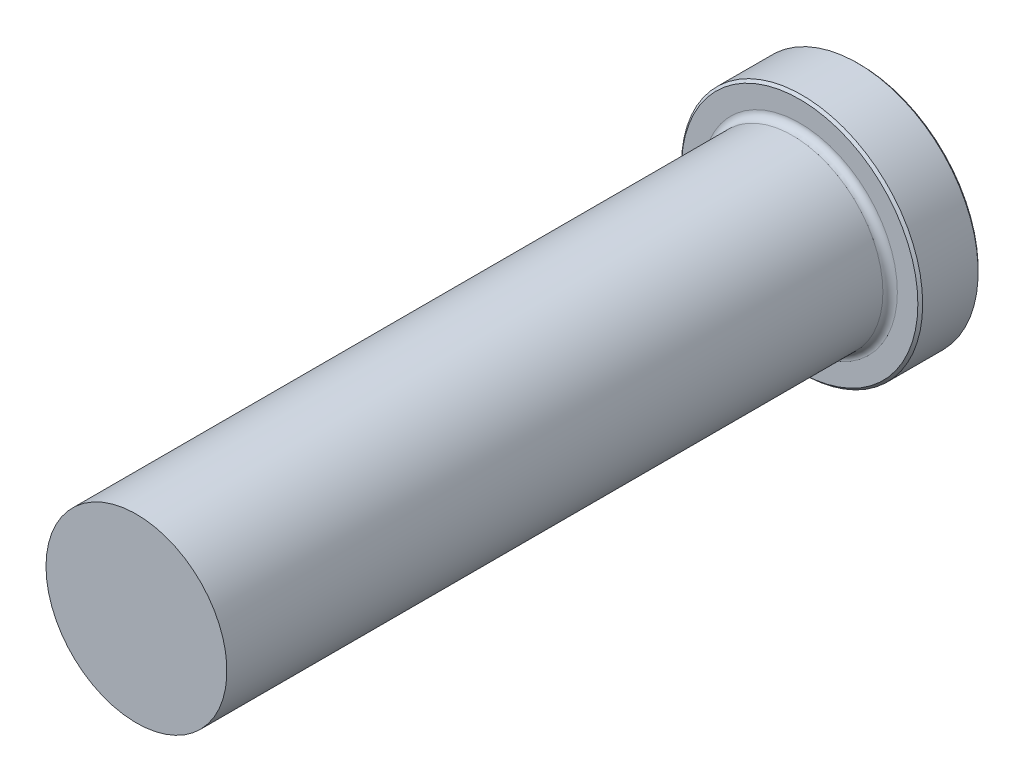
ISO-10303-21;
HEADER;
FILE_DESCRIPTION(('STEP AP214'),'2;1');
FILE_NAME('part.step','',(''),(''),'','','');
FILE_SCHEMA(('AUTOMOTIVE_DESIGN { 1 0 10303 214 1 1 1 1 }'));
ENDSEC;
DATA;
#1=APPLICATION_CONTEXT('core data for automotive mechanical design processes');
#2=APPLICATION_PROTOCOL_DEFINITION('international standard','automotive_design',2000,#1);
#3=PRODUCT_CONTEXT('',#1,'mechanical');
#4=PRODUCT('Part','Part','',(#3));
#5=PRODUCT_RELATED_PRODUCT_CATEGORY('part','',(#4));
#6=PRODUCT_DEFINITION_FORMATION('','',#4);
#7=PRODUCT_DEFINITION_CONTEXT('part definition',#1,'design');
#8=PRODUCT_DEFINITION('design','',#6,#7);
#9=PRODUCT_DEFINITION_SHAPE('','',#8);
#10=(LENGTH_UNIT() NAMED_UNIT(*) SI_UNIT(.MILLI.,.METRE.));
#11=(NAMED_UNIT(*) PLANE_ANGLE_UNIT() SI_UNIT($,.RADIAN.));
#12=(NAMED_UNIT(*) SI_UNIT($,.STERADIAN.) SOLID_ANGLE_UNIT());
#13=UNCERTAINTY_MEASURE_WITH_UNIT(LENGTH_MEASURE(1.E-05),#10,'distance_accuracy_value','');
#14=(GEOMETRIC_REPRESENTATION_CONTEXT(3) GLOBAL_UNCERTAINTY_ASSIGNED_CONTEXT((#13)) GLOBAL_UNIT_ASSIGNED_CONTEXT((#10,
#11,#12)) REPRESENTATION_CONTEXT('',''));
#15=CARTESIAN_POINT('',(0.,0.,0.));
#16=DIRECTION('',(0.,0.,1.));
#17=DIRECTION('',(1.,0.,0.));
#18=AXIS2_PLACEMENT_3D('',#15,#16,#17);
#19=CARTESIAN_POINT('',(0.,0.,0.));
#20=DIRECTION('',(0.,0.,-1.));
#21=DIRECTION('',(-1.,0.,0.));
#22=AXIS2_PLACEMENT_3D('',#19,#20,#21);
#23=PLANE('',#22);
#24=CARTESIAN_POINT('',(0.,0.,0.));
#25=DIRECTION('',(0.,0.,-1.));
#26=DIRECTION('',(-1.,0.,0.));
#27=AXIS2_PLACEMENT_3D('',#24,#25,#26);
#28=CIRCLE('',#27,12.446);
#29=CARTESIAN_POINT('',(-12.446,0.,0.));
#30=VERTEX_POINT('',#29);
#31=EDGE_CURVE('E50',#30,#30,#28,.T.);
#32=ORIENTED_EDGE('',*,*,#31,.T.);
#33=EDGE_LOOP('',(#32));
#34=FACE_BOUND('',#33,.T.);
#35=ADVANCED_FACE('F35',(#34),#23,.T.);
#36=CARTESIAN_POINT('',(0.,0.,0.));
#37=DIRECTION('',(0.,0.,-1.));
#38=DIRECTION('',(-1.,0.,0.));
#39=AXIS2_PLACEMENT_3D('',#36,#37,#38);
#40=CYLINDRICAL_SURFACE('',#39,12.7);
#41=CARTESIAN_POINT('',(0.,0.,0.254000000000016));
#42=DIRECTION('',(0.,0.,-1.));
#43=DIRECTION('',(-1.,0.,0.));
#44=AXIS2_PLACEMENT_3D('',#41,#42,#43);
#45=CIRCLE('',#44,12.7);
#46=CARTESIAN_POINT('',(-12.7,0.,0.254000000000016));
#47=VERTEX_POINT('',#46);
#48=EDGE_CURVE('E42',#47,#47,#45,.F.);
#49=ORIENTED_EDGE('',*,*,#48,.T.);
#50=EDGE_LOOP('',(#49));
#51=FACE_BOUND('',#50,.T.);
#52=CARTESIAN_POINT('',(0.,0.,6.096));
#53=DIRECTION('',(0.,0.,1.));
#54=DIRECTION('',(1.,0.,0.));
#55=AXIS2_PLACEMENT_3D('',#52,#53,#54);
#56=CIRCLE('',#55,12.7);
#57=CARTESIAN_POINT('',(12.7,0.,6.096));
#58=VERTEX_POINT('',#57);
#59=EDGE_CURVE('E46',#58,#58,#56,.F.);
#60=ORIENTED_EDGE('',*,*,#59,.T.);
#61=EDGE_LOOP('',(#60));
#62=FACE_BOUND('',#61,.T.);
#63=ADVANCED_FACE('F82',(#51,#62),#40,.T.);
#64=CARTESIAN_POINT('',(0.,12.7,6.35));
#65=DIRECTION('',(0.,0.,1.));
#66=DIRECTION('',(1.,0.,0.));
#67=AXIS2_PLACEMENT_3D('',#64,#65,#66);
#68=PLANE('',#67);
#69=CARTESIAN_POINT('',(0.,0.,6.35));
#70=DIRECTION('',(0.,0.,1.));
#71=DIRECTION('',(1.,0.,0.));
#72=AXIS2_PLACEMENT_3D('',#69,#70,#71);
#73=CIRCLE('',#72,12.446);
#74=CARTESIAN_POINT('',(12.446,0.,6.35));
#75=VERTEX_POINT('',#74);
#76=EDGE_CURVE('E10',#75,#75,#73,.T.);
#77=ORIENTED_EDGE('',*,*,#76,.T.);
#78=EDGE_LOOP('',(#77));
#79=FACE_BOUND('',#78,.T.);
#80=CARTESIAN_POINT('',(0.,0.,6.35));
#81=DIRECTION('',(0.,0.,1.));
#82=DIRECTION('',(1.,0.,0.));
#83=AXIS2_PLACEMENT_3D('',#80,#81,#82);
#84=CIRCLE('',#83,10.287);
#85=CARTESIAN_POINT('',(10.287,0.,6.35));
#86=VERTEX_POINT('',#85);
#87=EDGE_CURVE('E58',#86,#86,#84,.F.);
#88=ORIENTED_EDGE('',*,*,#87,.T.);
#89=EDGE_LOOP('',(#88));
#90=FACE_BOUND('',#89,.T.);
#91=ADVANCED_FACE('F78',(#79,#90),#68,.T.);
#92=CARTESIAN_POINT('',(0.,0.,0.));
#93=DIRECTION('',(0.,0.,-1.));
#94=DIRECTION('',(-1.,0.,0.));
#95=AXIS2_PLACEMENT_3D('',#92,#93,#94);
#96=CYLINDRICAL_SURFACE('',#95,9.525);
#97=CARTESIAN_POINT('',(0.,0.,7.112));
#98=DIRECTION('',(0.,0.,1.));
#99=DIRECTION('',(1.,0.,0.));
#100=AXIS2_PLACEMENT_3D('',#97,#98,#99);
#101=CIRCLE('',#100,9.525);
#102=CARTESIAN_POINT('',(9.525,0.,7.112));
#103=VERTEX_POINT('',#102);
#104=EDGE_CURVE('E55',#103,#103,#101,.T.);
#105=ORIENTED_EDGE('',*,*,#104,.T.);
#106=EDGE_LOOP('',(#105));
#107=FACE_BOUND('',#106,.T.);
#108=CARTESIAN_POINT('',(0.,0.,76.2));
#109=DIRECTION('',(0.,0.,-1.));
#110=DIRECTION('',(-1.,0.,0.));
#111=AXIS2_PLACEMENT_3D('',#108,#109,#110);
#112=CIRCLE('',#111,9.52499999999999);
#113=CARTESIAN_POINT('',(-9.52499999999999,0.,76.2));
#114=VERTEX_POINT('',#113);
#115=EDGE_CURVE('E61',#114,#114,#112,.T.);
#116=ORIENTED_EDGE('',*,*,#115,.T.);
#117=EDGE_LOOP('',(#116));
#118=FACE_BOUND('',#117,.T.);
#119=ADVANCED_FACE('F65',(#107,#118),#96,.T.);
#120=CARTESIAN_POINT('',(0.,9.52499999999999,76.2));
#121=DIRECTION('',(0.,0.,1.));
#122=DIRECTION('',(1.,0.,0.));
#123=AXIS2_PLACEMENT_3D('',#120,#121,#122);
#124=PLANE('',#123);
#125=ORIENTED_EDGE('',*,*,#115,.F.);
#126=EDGE_LOOP('',(#125));
#127=FACE_BOUND('',#126,.T.);
#128=ADVANCED_FACE('F67',(#127),#124,.T.);
#129=CARTESIAN_POINT('',(0.,0.,7.112));
#130=DIRECTION('',(0.,0.,1.));
#131=DIRECTION('',(1.,0.,0.));
#132=AXIS2_PLACEMENT_3D('',#129,#130,#131);
#133=TOROIDAL_SURFACE('',#132,10.287,0.762);
#134=ORIENTED_EDGE('',*,*,#104,.F.);
#135=EDGE_LOOP('',(#134));
#136=FACE_BOUND('',#135,.T.);
#137=ORIENTED_EDGE('',*,*,#87,.F.);
#138=EDGE_LOOP('',(#137));
#139=FACE_BOUND('',#138,.T.);
#140=ADVANCED_FACE('F69',(#136,#139),#133,.F.);
#141=CARTESIAN_POINT('',(0.,0.,0.));
#142=DIRECTION('',(0.,0.,1.));
#143=DIRECTION('',(1.,0.,0.));
#144=AXIS2_PLACEMENT_3D('',#141,#142,#143);
#145=CONICAL_SURFACE('',#144,12.446,0.785398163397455);
#146=ORIENTED_EDGE('',*,*,#48,.F.);
#147=EDGE_LOOP('',(#146));
#148=FACE_BOUND('',#147,.T.);
#149=ORIENTED_EDGE('',*,*,#31,.F.);
#150=EDGE_LOOP('',(#149));
#151=FACE_BOUND('',#150,.T.);
#152=ADVANCED_FACE('F75',(#148,#151),#145,.T.);
#153=CARTESIAN_POINT('',(0.,0.,6.096));
#154=DIRECTION('',(0.,0.,-1.));
#155=DIRECTION('',(-1.,0.,0.));
#156=AXIS2_PLACEMENT_3D('',#153,#154,#155);
#157=CONICAL_SURFACE('',#156,12.7,0.785398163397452);
#158=ORIENTED_EDGE('',*,*,#76,.F.);
#159=EDGE_LOOP('',(#158));
#160=FACE_BOUND('',#159,.T.);
#161=ORIENTED_EDGE('',*,*,#59,.F.);
#162=EDGE_LOOP('',(#161));
#163=FACE_BOUND('',#162,.T.);
#164=ADVANCED_FACE('F37',(#160,#163),#157,.T.);
#165=CLOSED_SHELL('',(#35,#63,#91,#119,#128,#140,#152,#164));
#166=MANIFOLD_SOLID_BREP('B2',#165);
#167=ADVANCED_BREP_SHAPE_REPRESENTATION('',(#18,#166),#14);
#168=SHAPE_DEFINITION_REPRESENTATION(#9,#167);
ENDSEC;
END-ISO-10303-21;
